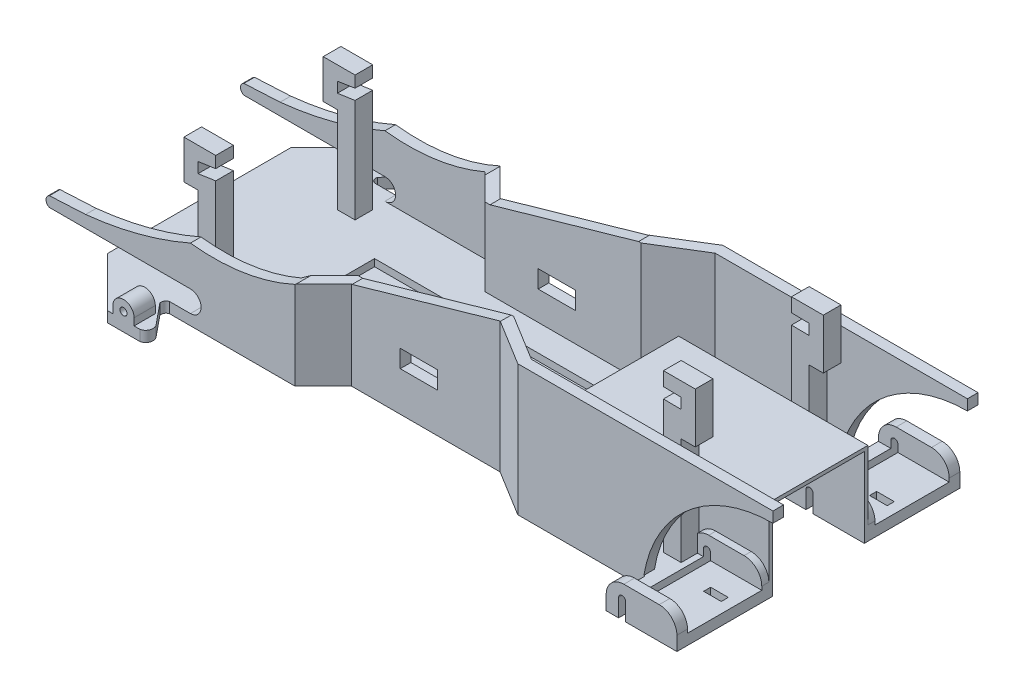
from build123d import *

# Parameters (mm, degrees)
SKETCH2_W            = 4.995942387
SKETCH2_H            = 1.998376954
SKETCH2_W_2          = 10
SKETCH2_H_2          = 5.5
SKETCH2_W_3          = 78.5
SKETCH2_H_3          = 21
BOSS_EXTRUDE1_DEPTH  = 3
BOSS_EXTRUDE2_DEPTH  = 3
SKETCH4_3_W          = 2
SKETCH4_3_H          = 3
CUT_EXTRUDE1_DEPTH   = 118
BOSS_EXTRUDE3_DEPTH  = 6
SKETCH6_W            = 55.055283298
SKETCH6_H            = 3
BOSS_EXTRUDE4_DEPTH  = 118
CUT_EXTRUDE3_DEPTH   = 215
SKETCH10_W           = 5
SKETCH10_H           = 5
BOSS_EXTRUDE5_DEPTH  = 35.5
SKETCH11_W           = 9
SKETCH11_H           = 11
BOSS_EXTRUDE7_DEPTH  = 5
BOSS_EXTRUDE8_START  = 1.6
SKETCH11_3_W         = 9
SKETCH11_3_H         = 14.2
BOSS_EXTRUDE8_DEPTH  = 5
CUT_EXTRUDE4_DEPTH   = 17.5
SKETCH13_W           = 53.5
SKETCH13_H           = 28
BOSS_EXTRUDE9_DEPTH  = 23.5
SKETCH13_3_W         = 38
SKETCH13_3_H         = 26
SKETCH13_3_W_2       = 14.5
CUT_EXTRUDE5_DEPTH   = 22.5
SKETCH14_W           = 78.5
SKETCH14_H           = 21
BOSS_EXTRUDE10_DEPTH = 1
BOSS_EXTRUDE11_START = 2
BOSS_EXTRUDE11_DEPTH = 2
SKETCH15_W           = 10.5
SKETCH15_H           = 5
CUT_EXTRUDE6_DEPTH   = 87
CUT_EXTRUDE7_DEPTH   = 69


with BuildPart() as part:
    # Sketch2 → Boss-Extrude1 (new body)
    with BuildSketch(Plane(origin=(0, 0, 0), x_dir=(1, 0, 0), z_dir=(0, 1, 0))):
        with BuildLine():
            Line((189.414520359, 224.136324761), (189.414520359, 144.136324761))
            Line((189.414520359, 144.136324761), (169.414520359, 144.136324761))
            Line((169.414520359, 144.136324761), (169.414520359, 155.142816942))
            Line((169.414520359, 155.142816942), (133.414520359, 155.142816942))
            Line((133.414520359, 155.142816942), (120.414520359, 163.136324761))
            Line((120.414520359, 163.136324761), (78.414520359, 163.136324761))
            Line((78.414520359, 163.136324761), (70.414520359, 155.136324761))
            Line((70.414520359, 155.136324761), (34.948882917, 155.136324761))
            ThreePointArc((34.948882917, 155.136324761), (34.086095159, 154.4742852), (33.944144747, 153.396069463))
            Line((33.944144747, 153.396069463), (38.862029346, 147.376010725))
            ThreePointArc((38.862029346, 147.376010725), (39.083653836, 145.392230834), (37.532138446, 144.136324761))
            Line((37.532138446, 144.136324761), (28.414520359, 144.136324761))
            Line((28.414520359, 144.136324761), (14.414520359, 158.136324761))
            Line((14.414520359, 158.136324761), (14.414520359, 210.136324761))
            Line((14.414520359, 210.136324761), (28.414520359, 224.136324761))
            Line((28.414520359, 224.136324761), (37.532138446, 224.136324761))
            ThreePointArc((37.532138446, 224.136324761), (39.083653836, 222.880418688), (38.862029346, 220.896638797))
            Line((38.862029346, 220.896638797), (33.944144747, 214.876580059))
            ThreePointArc((33.944144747, 214.876580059), (34.086095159, 213.798364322), (34.948882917, 213.136324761))
            Line((34.948882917, 213.136324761), (70.414520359, 213.136324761))
            Line((70.414520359, 213.136324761), (78.414520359, 205.136324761))
            Line((78.414520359, 205.136324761), (120.414520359, 205.136324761))
            Line((120.414520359, 205.136324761), (133.414520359, 213.12983258))
            Line((133.414520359, 213.12983258), (169.414520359, 213.12983258))
            Line((169.414520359, 213.12983258), (169.414520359, 224.136324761))
            Line((169.414520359, 224.136324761), (189.414520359, 224.136324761))
        make_face()
        with Locations((183.918983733, 207.60118076)):
            Rectangle(SKETCH2_W, SKETCH2_H, mode=Mode.SUBTRACT)
        with Locations((147.414520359, 207.37983258)):
            Rectangle(SKETCH2_W_2, SKETCH2_H_2, mode=Mode.SUBTRACT)
        with Locations((92.664520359, 184.136324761)):
            Rectangle(SKETCH2_W_3, SKETCH2_H_3, mode=Mode.SUBTRACT)
        with Locations((147.414520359, 160.892816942)):
            Rectangle(SKETCH2_W_2, SKETCH2_H_2, mode=Mode.SUBTRACT)
        with Locations((183.918983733, 160.671468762)):
            Rectangle(SKETCH2_W, SKETCH2_H, mode=Mode.SUBTRACT)
    extrude(amount=BOSS_EXTRUDE1_DEPTH)

    # Sketch4 → Boss-Extrude2 (add)
    with BuildSketch(Plane(origin=(0, 0, -224.136324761), x_dir=(-1, 0, 0), z_dir=(0, 0, -1))):
        with BuildLine():
            Line((-172.914520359, 3), (-169.414520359, 3))
            Line((-169.414520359, 3), (-169.414520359, 4))
            ThreePointArc((-169.414520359, 4), (-170.878986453, 7.535533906), (-174.414520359, 9))
            Line((-174.414520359, 9), (-184.414520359, 9))
            ThreePointArc((-184.414520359, 9), (-187.950054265, 7.535533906), (-189.414520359, 4))
            Line((-189.414520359, 4), (-189.414520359, 3))
            Line((-189.414520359, 3), (-174.914520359, 3))
            Line((-174.914520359, 3), (-174.914520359, 5))
            ThreePointArc((-174.914520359, 5), (-173.914520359, 6), (-172.914520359, 5))
            Line((-172.914520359, 5), (-172.914520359, 3))
        make_face()
    extrude(amount=-BOSS_EXTRUDE2_DEPTH)

    # Sketch4_3 → Cut-Extrude1 (cut)
    with BuildSketch(Plane(origin=(0, 0, -224.136324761), x_dir=(-1, 0, 0), z_dir=(0, 0, -1))):
        with Locations((-173.914520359, 1.5)):
            Rectangle(SKETCH4_3_W, SKETCH4_3_H)
    extrude(amount=-CUT_EXTRUDE1_DEPTH, mode=Mode.SUBTRACT)

    # Sketch5 → Boss-Extrude3 (add)
    with BuildSketch(Plane(origin=(0, 0, -224.136324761), x_dir=(-1, 0, 0), z_dir=(0, 0, -1))):
        with BuildLine():
            Line((-29.914520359, 0), (-29.914520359, 3))
            Line((-29.914520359, 3), (-30.678452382, 3))
            ThreePointArc((-30.678452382, 3), (-31.244308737, 2.507933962), (-31.914520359, 2.171572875))
            Line((-31.914520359, 2.171572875), (-31.914520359, 0))
            Line((-31.914520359, 0), (-29.914520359, 0))
        make_face()
        with BuildLine():
            Line((-29.914520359, 3), (-29.914520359, 5))
            ThreePointArc((-29.914520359, 5), (-30.112003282, 3.929533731), (-30.678452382, 3))
            Line((-30.678452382, 3), (-29.914520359, 3))
        make_face()
        with BuildLine():
            ThreePointArc((-30.678452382, 3), (-30.112003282, 3.929533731), (-29.914520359, 5))
            ThreePointArc((-29.914520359, 5), (-32.914520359, 8), (-35.914520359, 5))
            ThreePointArc((-35.914520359, 5), (-35.717037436, 3.929533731), (-35.150588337, 3))
            Line((-35.150588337, 3), (-33.914520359, 3))
            Line((-33.914520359, 3), (-33.914520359, 5))
            ThreePointArc((-33.914520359, 5), (-32.914520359, 6), (-31.914520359, 5))
            Line((-31.914520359, 5), (-31.914520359, 3))
            Line((-31.914520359, 3), (-30.678452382, 3))
        make_face()
        with BuildLine():
            ThreePointArc((-35.150588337, 3), (-35.717037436, 3.929533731), (-35.914520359, 5))
            Line((-35.914520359, 5), (-35.914520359, 3))
            Line((-35.914520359, 3), (-35.150588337, 3))
        make_face()
        with BuildLine():
            Line((-35.150588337, 3), (-35.914520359, 3))
            Line((-35.914520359, 3), (-35.914520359, 0))
            Line((-35.914520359, 0), (-33.914520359, 0))
            Line((-33.914520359, 0), (-33.914520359, 2.171572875))
            ThreePointArc((-33.914520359, 2.171572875), (-34.584731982, 2.507933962), (-35.150588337, 3))
        make_face()
        with BuildLine():
            ThreePointArc((-31.914520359, 2.171572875), (-31.244308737, 2.507933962), (-30.678452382, 3))
            Line((-30.678452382, 3), (-31.914520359, 3))
            Line((-31.914520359, 3), (-31.914520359, 2.171572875))
        make_face()
        with BuildLine():
            Line((-33.914520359, 3), (-35.150588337, 3))
            ThreePointArc((-35.150588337, 3), (-34.584731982, 2.507933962), (-33.914520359, 2.171572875))
            Line((-33.914520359, 2.171572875), (-33.914520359, 3))
        make_face()
        with BuildLine():
            Line((-33.914520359, 3), (-31.914520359, 3))
            Line((-31.914520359, 3), (-31.914520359, 5))
            ThreePointArc((-31.914520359, 5), (-32.914520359, 4), (-33.914520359, 5))
            Line((-33.914520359, 5), (-33.914520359, 3))
        make_face()
        with BuildLine():
            ThreePointArc((-33.914520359, 2.171572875), (-32.914520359, 2), (-31.914520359, 2.171572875))
            Line((-31.914520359, 2.171572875), (-31.914520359, 3))
            Line((-31.914520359, 3), (-33.914520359, 3))
            Line((-33.914520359, 3), (-33.914520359, 2.171572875))
        make_face()
        with BuildLine():
            Line((-31.914520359, 0), (-31.914520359, 2.171572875))
            ThreePointArc((-31.914520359, 2.171572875), (-32.914520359, 2), (-33.914520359, 2.171572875))
            Line((-33.914520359, 2.171572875), (-33.914520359, 0))
            Line((-33.914520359, 0), (-31.914520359, 0))
        make_face()
    extrude(amount=-BOSS_EXTRUDE3_DEPTH)

    # Sketch6 → Boss-Extrude4 (add)
    with BuildSketch(Plane(origin=(0, 3, 0), x_dir=(1, 0, 0), z_dir=(0, 1, 0))):
        Polygon((14.414520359, 210.136324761), (17.414520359, 213.136324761), (-9.300336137, 213.136324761), (-9.300336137, 210.136324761), align=None)
        Polygon((34.948882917, 210.136324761), (34.948882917, 213.136324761), (17.414520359, 213.136324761), (14.414520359, 210.136324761), align=None)
        Polygon((70.414520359, 213.136324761), (34.948882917, 213.136324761), (34.948882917, 210.136324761), (69.171879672, 210.136324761), (77.171879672, 202.136324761), (121.263059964, 202.136324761), (134.263059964, 210.12983258), (169.414520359, 210.12983258), (172.914520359, 210.12983258), (172.914520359, 213.12983258), (169.414520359, 213.12983258), (133.414520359, 213.12983258), (120.414520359, 205.136324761), (78.414520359, 205.136324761), align=None)
        with Locations((200.442162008, 211.62983258)):
            Rectangle(SKETCH6_W, SKETCH6_H)
    extrude(amount=BOSS_EXTRUDE4_DEPTH)

    # Sketch9 → Cut-Extrude3 (cut)
    with BuildSketch(Plane.XY):
        with BuildLine():
            ThreePointArc((70.568359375, 25), (56.035904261, 20.55420196), (40.841400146, 20.263656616))
            ThreePointArc((40.841400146, 20.263656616), (26.32728613, 15.202377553), (11.204636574, 12.448921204))
            Line((11.204636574, 12.448921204), (0.964873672, 11.92616272))
            ThreePointArc((0.964873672, 11.92616272), (1.017e-06, 10.482128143), (0.964873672, 9.038093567))
            Line((0.964873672, 9.038093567), (40.841400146, 9.038093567))
            ThreePointArc((40.841400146, 9.038093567), (43.86044693, 6.019046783), (40.841400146, 3))
            Line((40.841400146, 3), (-9.300336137, 3))
            Line((-9.300336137, 3), (-9.300336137, 121))
            Line((-9.300336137, 121), (227.969803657, 121))
            Line((227.969803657, 121), (227.969803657, 3))
            Line((227.969803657, 3), (169.072814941, 3))
            ThreePointArc((169.072814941, 3), (181.618558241, 25.212860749), (205.568359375, 34.000003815))
            Line((205.568359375, 34.000003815), (205.568359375, 37.000003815))
            Line((205.568359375, 37.000003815), (120.568359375, 37.000003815))
            Line((120.568359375, 37.000003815), (78.568359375, 25))
            Line((78.568359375, 25), (70.568359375, 25))
        make_face()
    extrude(amount=-CUT_EXTRUDE3_DEPTH, mode=Mode.SUBTRACT)

    # Sketch10 → Boss-Extrude5 (add)
    with BuildSketch(Plane(origin=(0, 3, 0), x_dir=(1, 0, 0), z_dir=(0, 1, 0))):
        with Locations((38.699820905, 203.836324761)):
            Rectangle(SKETCH10_W, SKETCH10_H)
        with Locations((168.714520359, 202.236324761)):
            Rectangle(SKETCH10_W, SKETCH10_H)
    extrude(amount=BOSS_EXTRUDE5_DEPTH)

    # Sketch11 → Boss-Extrude7 (add)
    with BuildSketch(Plane.XY.offset(-201.336324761)):
        with Locations((36.699820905, 33)):
            Rectangle(SKETCH11_W, SKETCH11_H)
    extrude(amount=-BOSS_EXTRUDE7_DEPTH)

    # Sketch11_3 → Boss-Extrude8 (add)
    with BuildSketch(Plane.XY.offset(-201.336324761).offset(BOSS_EXTRUDE8_START)):
        with Locations((170.714520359, 40.4)):
            Rectangle(SKETCH11_3_W, SKETCH11_3_H)
    extrude(amount=-BOSS_EXTRUDE8_DEPTH)

    # Sketch12 → Cut-Extrude4 (cut, symmetric)
    with BuildSketch(Plane.XY.offset(-201.336324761)):
        with BuildLine():
            Line((36.199820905, 34.5), (36.199820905, 31.536094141))
            add(Edge.make_bspline(
                [(36.199820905, 31.536094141), (103.298468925, 41.642157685), (171.148075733, 40.500735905)],
                knots=[0, 0, 0, 1, 1, 1], degree=2))
            Line((171.148075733, 40.500735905), (171.214520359, 43.5))
            add(Edge.make_bspline(
                [(36.199820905, 34.5), (80.936395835, 41.502966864), (125.941295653, 44.502966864), (171.214520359, 43.5)],
                knots=[0, 0, 0, 0, 1, 1, 1, 1], degree=3))
        make_face()
    extrude(amount=CUT_EXTRUDE4_DEPTH, both=True, mode=Mode.SUBTRACT)

    # Sketch13 → Boss-Extrude9 (add)
    with BuildSketch(Plane.XZ):
        with Locations((162.664520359, -184.136324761)):
            Rectangle(SKETCH13_W, SKETCH13_H)
    extrude(amount=-BOSS_EXTRUDE9_DEPTH)

    # Sketch13_3 → Cut-Extrude5 (cut)
    with BuildSketch(Plane.XZ):
        with Locations((155.914520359, -184.136324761)):
            Rectangle(SKETCH13_3_W, SKETCH13_3_H)
        with Locations((182.164520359, -184.136324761)):
            Rectangle(SKETCH13_3_W_2, SKETCH13_3_H)
    extrude(amount=-CUT_EXTRUDE5_DEPTH, mode=Mode.SUBTRACT)

    # Sketch14 → Boss-Extrude10 (add)
    with BuildSketch(Plane.XZ):
        with Locations((92.664520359, -184.136324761)):
            Rectangle(SKETCH14_W, SKETCH14_H)
    extrude(amount=-BOSS_EXTRUDE10_DEPTH)

    # Sketch17 → Boss-Extrude11 (add)
    with BuildSketch(Plane(origin=(0, 0, -198.136324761), x_dir=(-1, 0, 0), z_dir=(0, 0, -1)).offset(BOSS_EXTRUDE11_START)):
        with BuildLine():
            Line((-189.414520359, 0), (-174.914520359, 0))
            Line((-174.914520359, 0), (-174.914520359, 5))
            ThreePointArc((-174.914520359, 5), (-173.914520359, 6), (-172.914520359, 5))
            Line((-172.914520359, 5), (-172.914520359, 0))
            Line((-172.914520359, 0), (-169.414520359, 0))
            Line((-169.414520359, 0), (-169.414520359, 4))
            ThreePointArc((-169.414520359, 4), (-170.878986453, 7.535533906), (-174.414520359, 9))
            Line((-174.414520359, 9), (-184.414520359, 9))
            ThreePointArc((-184.414520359, 9), (-187.950054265, 7.535533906), (-189.414520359, 4))
            Line((-189.414520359, 4), (-189.414520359, 0))
        make_face()
    extrude(amount=-BOSS_EXTRUDE11_DEPTH)

    # Mirror1: part across plane


with BuildPart() as part_1:
    add(part.part)
    add(part.part.mirror(Plane.XY.offset(-184.136324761)))

    # Sketch15 → Cut-Extrude6 (cut)
    with BuildSketch(Plane.XY.offset(-163.136324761)):
        with Locations((97.430126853, 13.666631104)):
            Rectangle(SKETCH15_W, SKETCH15_H)
    extrude(amount=-CUT_EXTRUDE6_DEPTH, mode=Mode.SUBTRACT)

    # Sketch18 → Cut-Extrude7 (cut)
    with BuildSketch(Plane(origin=(0, 0, -198.136324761), x_dir=(-1, 0, 0), z_dir=(0, 0, -1))):
        with BuildLine():
            Line((-174.914520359, 5), (-174.914520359, 0))
            Line((-174.914520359, 0), (-172.914520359, 0))
            Line((-172.914520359, 0), (-172.914520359, 5))
            ThreePointArc((-172.914520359, 5), (-173.914520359, 6), (-174.914520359, 5))
        make_face()
    extrude(amount=-CUT_EXTRUDE7_DEPTH, mode=Mode.SUBTRACT)


solid = part_1.part
